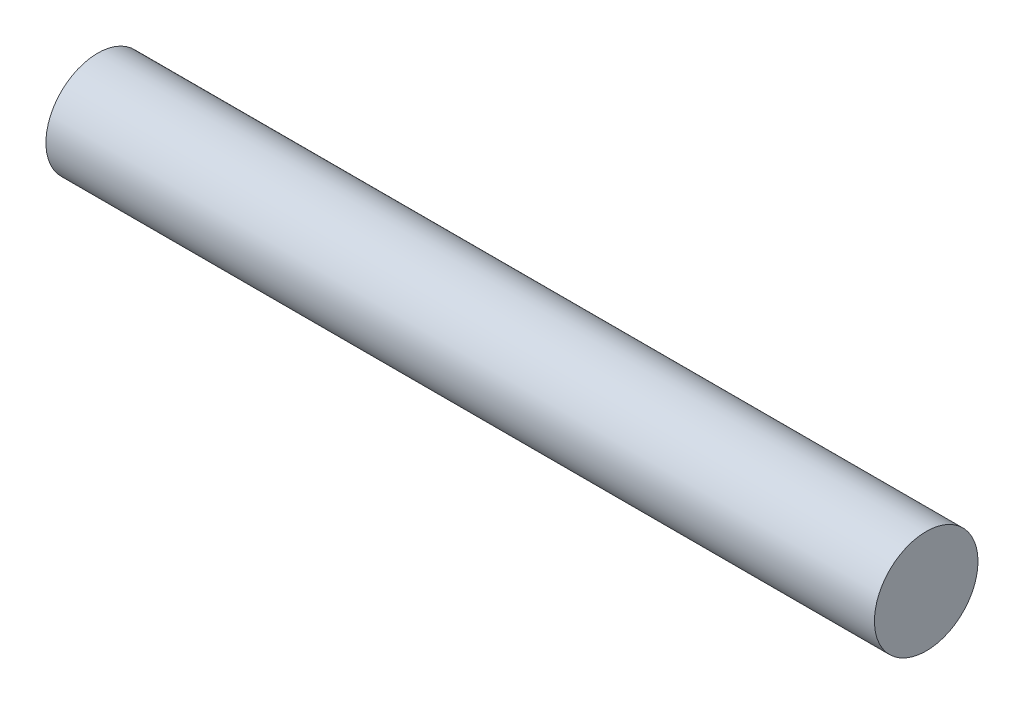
ISO-10303-21;
HEADER;
FILE_DESCRIPTION(('STEP AP214'),'2;1');
FILE_NAME('part.step','',(''),(''),'','','');
FILE_SCHEMA(('AUTOMOTIVE_DESIGN { 1 0 10303 214 1 1 1 1 }'));
ENDSEC;
DATA;
#1=APPLICATION_CONTEXT('core data for automotive mechanical design processes');
#2=APPLICATION_PROTOCOL_DEFINITION('international standard','automotive_design',2000,#1);
#3=PRODUCT_CONTEXT('',#1,'mechanical');
#4=PRODUCT('Part','Part','',(#3));
#5=PRODUCT_RELATED_PRODUCT_CATEGORY('part','',(#4));
#6=PRODUCT_DEFINITION_FORMATION('','',#4);
#7=PRODUCT_DEFINITION_CONTEXT('part definition',#1,'design');
#8=PRODUCT_DEFINITION('design','',#6,#7);
#9=PRODUCT_DEFINITION_SHAPE('','',#8);
#10=(LENGTH_UNIT() NAMED_UNIT(*) SI_UNIT(.MILLI.,.METRE.));
#11=(NAMED_UNIT(*) PLANE_ANGLE_UNIT() SI_UNIT($,.RADIAN.));
#12=(NAMED_UNIT(*) SI_UNIT($,.STERADIAN.) SOLID_ANGLE_UNIT());
#13=UNCERTAINTY_MEASURE_WITH_UNIT(LENGTH_MEASURE(1.E-05),#10,'distance_accuracy_value','');
#14=(GEOMETRIC_REPRESENTATION_CONTEXT(3) GLOBAL_UNCERTAINTY_ASSIGNED_CONTEXT((#13)) GLOBAL_UNIT_ASSIGNED_CONTEXT((#10,
#11,#12)) REPRESENTATION_CONTEXT('',''));
#15=CARTESIAN_POINT('',(0.,0.,0.));
#16=DIRECTION('',(0.,0.,1.));
#17=DIRECTION('',(1.,0.,0.));
#18=AXIS2_PLACEMENT_3D('',#15,#16,#17);
#19=CARTESIAN_POINT('',(120.,0.,0.));
#20=DIRECTION('',(-1.,0.,0.));
#21=DIRECTION('',(0.,0.,1.));
#22=AXIS2_PLACEMENT_3D('',#19,#20,#21);
#23=CYLINDRICAL_SURFACE('',#22,7.5);
#24=CARTESIAN_POINT('',(120.,0.,0.));
#25=DIRECTION('',(1.,0.,0.));
#26=DIRECTION('',(0.,0.,-1.));
#27=AXIS2_PLACEMENT_3D('',#24,#25,#26);
#28=CIRCLE('',#27,7.5);
#29=CARTESIAN_POINT('',(120.,0.,-7.5));
#30=VERTEX_POINT('',#29);
#31=EDGE_CURVE('E10',#30,#30,#28,.T.);
#32=ORIENTED_EDGE('',*,*,#31,.F.);
#33=EDGE_LOOP('',(#32));
#34=FACE_BOUND('',#33,.T.);
#35=CARTESIAN_POINT('',(0.,0.,0.));
#36=DIRECTION('',(1.,0.,0.));
#37=DIRECTION('',(0.,0.,-1.));
#38=AXIS2_PLACEMENT_3D('',#35,#36,#37);
#39=CIRCLE('',#38,7.5);
#40=CARTESIAN_POINT('',(0.,0.,-7.5));
#41=VERTEX_POINT('',#40);
#42=EDGE_CURVE('E36',#41,#41,#39,.T.);
#43=ORIENTED_EDGE('',*,*,#42,.T.);
#44=EDGE_LOOP('',(#43));
#45=FACE_BOUND('',#44,.T.);
#46=ADVANCED_FACE('F33',(#34,#45),#23,.T.);
#47=CARTESIAN_POINT('',(120.,0.,0.));
#48=DIRECTION('',(1.,0.,0.));
#49=DIRECTION('',(0.,0.,-1.));
#50=AXIS2_PLACEMENT_3D('',#47,#48,#49);
#51=PLANE('',#50);
#52=ORIENTED_EDGE('',*,*,#31,.T.);
#53=EDGE_LOOP('',(#52));
#54=FACE_BOUND('',#53,.T.);
#55=ADVANCED_FACE('F48',(#54),#51,.T.);
#56=CARTESIAN_POINT('',(0.,0.,0.));
#57=DIRECTION('',(1.,0.,0.));
#58=DIRECTION('',(0.,0.,-1.));
#59=AXIS2_PLACEMENT_3D('',#56,#57,#58);
#60=PLANE('',#59);
#61=ORIENTED_EDGE('',*,*,#42,.F.);
#62=EDGE_LOOP('',(#61));
#63=FACE_BOUND('',#62,.T.);
#64=ADVANCED_FACE('F46',(#63),#60,.F.);
#65=CLOSED_SHELL('',(#46,#55,#64));
#66=MANIFOLD_SOLID_BREP('B2',#65);
#67=ADVANCED_BREP_SHAPE_REPRESENTATION('',(#18,#66),#14);
#68=SHAPE_DEFINITION_REPRESENTATION(#9,#67);
ENDSEC;
END-ISO-10303-21;
